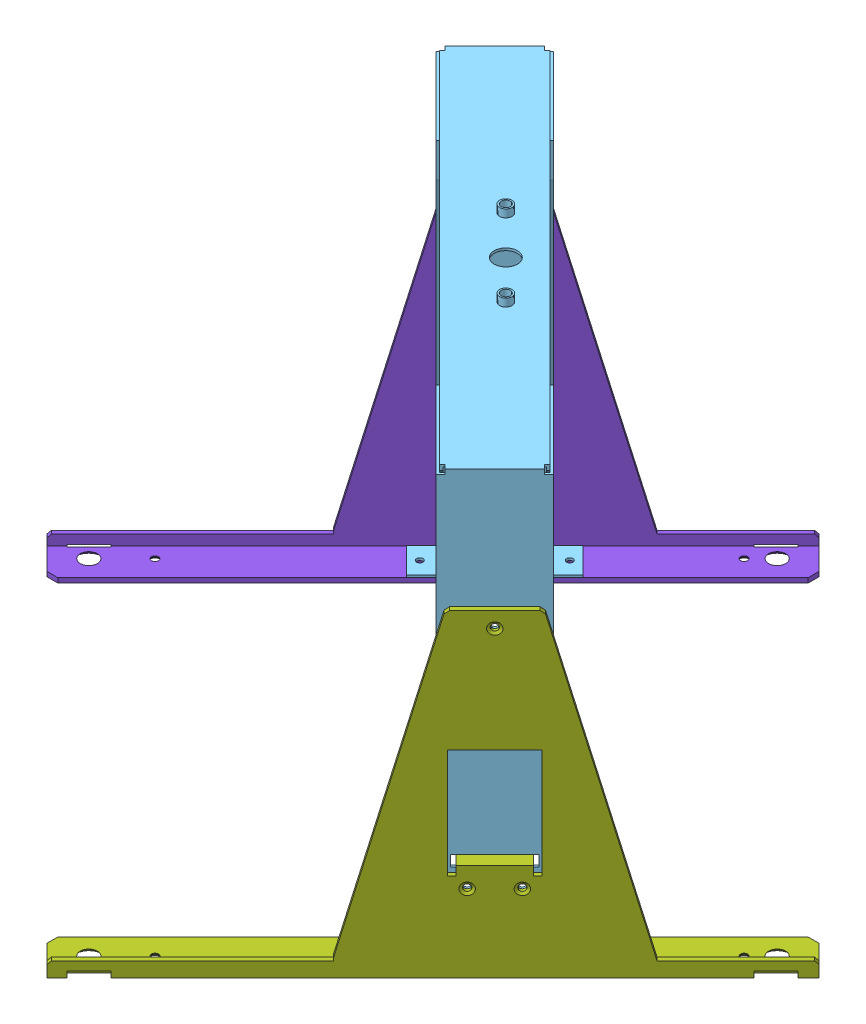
SolidWorks assembly Cadre.sldasm, configuration Default (file format 5000). Lengths in mm.
Overall size (486.49 285.5 486.49).
9 component instances, 9 part files, 0 mates.
Components (placement in the parent):
- 47-1: 47.sldprt [Default] at origin size (10 20 10)
- 52-1: 52.sldprt [Default] at origin size (2.12 27 2.12)
- 46-1: 46.sldprt [Default] at (302.0167 -77.4792 61.5183) x (0 0 1) z (0 1 0) size (18.3 18.3 20)
- 51-1: 51.sldprt [Default] at (139.3821 -77.4792 -101.1163) x (0 0 1) z (0 1 0) size (18.3 18.3 20)
- 50-1: 50.sldprt [Default] at origin size (288.5 282.5 288.5)
- 32-1: 32.sldprt [Default] at origin size (10 20 10)
- 53-1: 53.sldprt [Default] at origin size (263.75 204 263.75)
- 48-1: 48.sldprt [Default] at origin size (263.75 204 263.75)
- 33-1: 33.sldprt [Default] at origin size (4.95 1 4.95)
